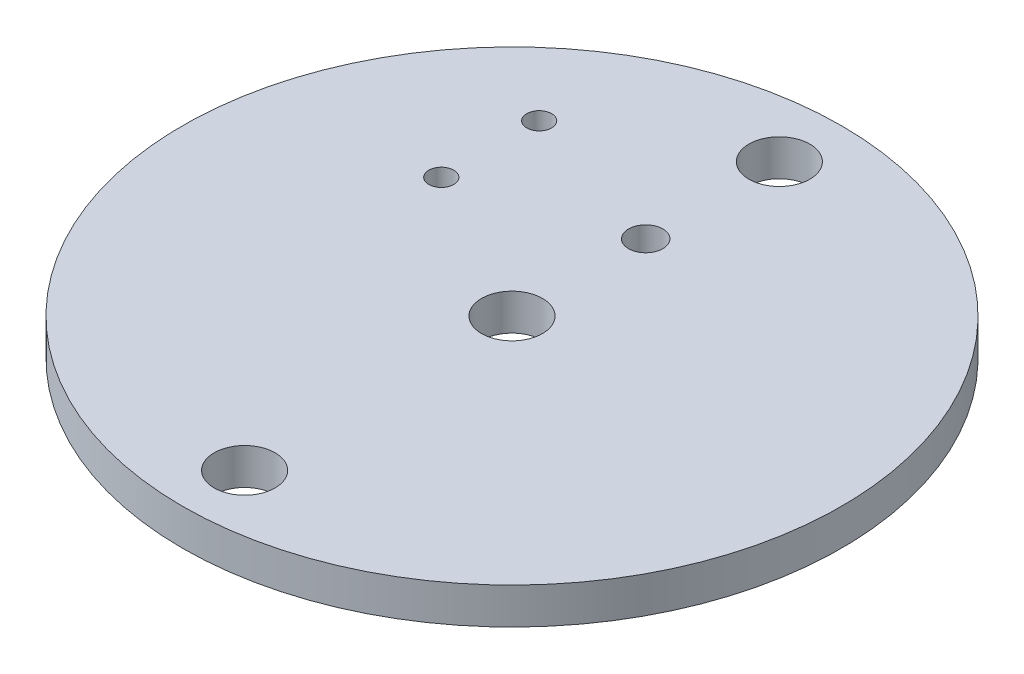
ISO-10303-21;
HEADER;
FILE_DESCRIPTION(('STEP AP214'),'2;1');
FILE_NAME('part.step','',(''),(''),'','','');
FILE_SCHEMA(('AUTOMOTIVE_DESIGN { 1 0 10303 214 1 1 1 1 }'));
ENDSEC;
DATA;
#1=APPLICATION_CONTEXT('core data for automotive mechanical design processes');
#2=APPLICATION_PROTOCOL_DEFINITION('international standard','automotive_design',2000,#1);
#3=PRODUCT_CONTEXT('',#1,'mechanical');
#4=PRODUCT('Part','Part','',(#3));
#5=PRODUCT_RELATED_PRODUCT_CATEGORY('part','',(#4));
#6=PRODUCT_DEFINITION_FORMATION('','',#4);
#7=PRODUCT_DEFINITION_CONTEXT('part definition',#1,'design');
#8=PRODUCT_DEFINITION('design','',#6,#7);
#9=PRODUCT_DEFINITION_SHAPE('','',#8);
#10=(LENGTH_UNIT() NAMED_UNIT(*) SI_UNIT(.MILLI.,.METRE.));
#11=(NAMED_UNIT(*) PLANE_ANGLE_UNIT() SI_UNIT($,.RADIAN.));
#12=(NAMED_UNIT(*) SI_UNIT($,.STERADIAN.) SOLID_ANGLE_UNIT());
#13=UNCERTAINTY_MEASURE_WITH_UNIT(LENGTH_MEASURE(1.E-05),#10,'distance_accuracy_value','');
#14=(GEOMETRIC_REPRESENTATION_CONTEXT(3) GLOBAL_UNCERTAINTY_ASSIGNED_CONTEXT((#13)) GLOBAL_UNIT_ASSIGNED_CONTEXT((#10,
#11,#12)) REPRESENTATION_CONTEXT('',''));
#15=CARTESIAN_POINT('',(0.,0.,0.));
#16=DIRECTION('',(0.,0.,1.));
#17=DIRECTION('',(1.,0.,0.));
#18=AXIS2_PLACEMENT_3D('',#15,#16,#17);
#19=CARTESIAN_POINT('',(0.,2.9718,0.));
#20=DIRECTION('',(0.,-1.,0.));
#21=DIRECTION('',(0.,0.,-1.));
#22=AXIS2_PLACEMENT_3D('',#19,#20,#21);
#23=CYLINDRICAL_SURFACE('',#22,26.924);
#24=CARTESIAN_POINT('',(0.,2.9718,0.));
#25=DIRECTION('',(0.,1.,0.));
#26=DIRECTION('',(0.,0.,1.));
#27=AXIS2_PLACEMENT_3D('',#24,#25,#26);
#28=CIRCLE('',#27,26.924);
#29=CARTESIAN_POINT('',(0.,2.9718,26.924));
#30=VERTEX_POINT('',#29);
#31=EDGE_CURVE('E10',#30,#30,#28,.T.);
#32=ORIENTED_EDGE('',*,*,#31,.F.);
#33=EDGE_LOOP('',(#32));
#34=FACE_BOUND('',#33,.T.);
#35=CARTESIAN_POINT('',(0.,0.,0.));
#36=DIRECTION('',(0.,1.,0.));
#37=DIRECTION('',(0.,0.,1.));
#38=AXIS2_PLACEMENT_3D('',#35,#36,#37);
#39=CIRCLE('',#38,26.924);
#40=CARTESIAN_POINT('',(0.,0.,26.924));
#41=VERTEX_POINT('',#40);
#42=EDGE_CURVE('E42',#41,#41,#39,.T.);
#43=ORIENTED_EDGE('',*,*,#42,.T.);
#44=EDGE_LOOP('',(#43));
#45=FACE_BOUND('',#44,.T.);
#46=ADVANCED_FACE('F39',(#34,#45),#23,.T.);
#47=CARTESIAN_POINT('',(0.,2.9718,0.));
#48=DIRECTION('',(0.,1.,0.));
#49=DIRECTION('',(0.,0.,1.));
#50=AXIS2_PLACEMENT_3D('',#47,#48,#49);
#51=PLANE('',#50);
#52=CARTESIAN_POINT('',(0.,2.9718,-10.922));
#53=DIRECTION('',(0.,1.,0.));
#54=DIRECTION('',(0.,0.,1.));
#55=AXIS2_PLACEMENT_3D('',#52,#53,#54);
#56=CIRCLE('',#55,1.4);
#57=CARTESIAN_POINT('',(0.,2.9718,-9.522));
#58=VERTEX_POINT('',#57);
#59=EDGE_CURVE('E93',#58,#58,#56,.T.);
#60=ORIENTED_EDGE('',*,*,#59,.F.);
#61=EDGE_LOOP('',(#60));
#62=FACE_BOUND('',#61,.T.);
#63=CARTESIAN_POINT('',(-12.7,2.9718,-14.922));
#64=DIRECTION('',(0.,1.,0.));
#65=DIRECTION('',(0.,0.,1.));
#66=AXIS2_PLACEMENT_3D('',#63,#64,#65);
#67=CIRCLE('',#66,1.016);
#68=CARTESIAN_POINT('',(-12.7,2.9718,-13.906));
#69=VERTEX_POINT('',#68);
#70=EDGE_CURVE('E85',#69,#69,#67,.T.);
#71=ORIENTED_EDGE('',*,*,#70,.F.);
#72=EDGE_LOOP('',(#71));
#73=FACE_BOUND('',#72,.T.);
#74=CARTESIAN_POINT('',(-12.7,2.9718,-6.922));
#75=DIRECTION('',(0.,1.,0.));
#76=DIRECTION('',(0.,0.,1.));
#77=AXIS2_PLACEMENT_3D('',#74,#75,#76);
#78=CIRCLE('',#77,1.016);
#79=CARTESIAN_POINT('',(-12.7,2.9718,-5.906));
#80=VERTEX_POINT('',#79);
#81=EDGE_CURVE('E77',#80,#80,#78,.T.);
#82=ORIENTED_EDGE('',*,*,#81,.F.);
#83=EDGE_LOOP('',(#82));
#84=FACE_BOUND('',#83,.T.);
#85=CARTESIAN_POINT('',(0.,2.9718,0.));
#86=DIRECTION('',(0.,1.,0.));
#87=DIRECTION('',(0.,0.,1.));
#88=AXIS2_PLACEMENT_3D('',#85,#86,#87);
#89=CIRCLE('',#88,2.4892);
#90=CARTESIAN_POINT('',(0.,2.9718,2.4892));
#91=VERTEX_POINT('',#90);
#92=EDGE_CURVE('E72',#91,#91,#89,.T.);
#93=ORIENTED_EDGE('',*,*,#92,.F.);
#94=EDGE_LOOP('',(#93));
#95=FACE_BOUND('',#94,.T.);
#96=CARTESIAN_POINT('',(0.,2.9718,21.844));
#97=DIRECTION('',(0.,1.,0.));
#98=DIRECTION('',(0.,0.,1.));
#99=AXIS2_PLACEMENT_3D('',#96,#97,#98);
#100=CIRCLE('',#99,2.4892);
#101=CARTESIAN_POINT('',(0.,2.9718,24.3332));
#102=VERTEX_POINT('',#101);
#103=EDGE_CURVE('E64',#102,#102,#100,.T.);
#104=ORIENTED_EDGE('',*,*,#103,.F.);
#105=EDGE_LOOP('',(#104));
#106=FACE_BOUND('',#105,.T.);
#107=CARTESIAN_POINT('',(0.,2.9718,-21.844));
#108=DIRECTION('',(0.,1.,0.));
#109=DIRECTION('',(0.,0.,1.));
#110=AXIS2_PLACEMENT_3D('',#107,#108,#109);
#111=CIRCLE('',#110,2.4892);
#112=CARTESIAN_POINT('',(0.,2.9718,-19.3548));
#113=VERTEX_POINT('',#112);
#114=EDGE_CURVE('E56',#113,#113,#111,.T.);
#115=ORIENTED_EDGE('',*,*,#114,.F.);
#116=EDGE_LOOP('',(#115));
#117=FACE_BOUND('',#116,.T.);
#118=ORIENTED_EDGE('',*,*,#31,.T.);
#119=EDGE_LOOP('',(#118));
#120=FACE_BOUND('',#119,.T.);
#121=ADVANCED_FACE('F111',(#62,#73,#84,#95,#106,#117,#120),#51,.T.);
#122=CARTESIAN_POINT('',(0.,0.,0.));
#123=DIRECTION('',(0.,1.,0.));
#124=DIRECTION('',(0.,0.,1.));
#125=AXIS2_PLACEMENT_3D('',#122,#123,#124);
#126=PLANE('',#125);
#127=CARTESIAN_POINT('',(0.,0.,-10.922));
#128=DIRECTION('',(0.,1.,0.));
#129=DIRECTION('',(0.,0.,1.));
#130=AXIS2_PLACEMENT_3D('',#127,#128,#129);
#131=CIRCLE('',#130,1.4);
#132=CARTESIAN_POINT('',(0.,0.,-9.522));
#133=VERTEX_POINT('',#132);
#134=EDGE_CURVE('E76',#133,#133,#131,.T.);
#135=ORIENTED_EDGE('',*,*,#134,.T.);
#136=EDGE_LOOP('',(#135));
#137=FACE_BOUND('',#136,.T.);
#138=CARTESIAN_POINT('',(-12.7,0.,-14.922));
#139=DIRECTION('',(0.,1.,0.));
#140=DIRECTION('',(0.,0.,1.));
#141=AXIS2_PLACEMENT_3D('',#138,#139,#140);
#142=CIRCLE('',#141,1.016);
#143=CARTESIAN_POINT('',(-12.7,0.,-13.906));
#144=VERTEX_POINT('',#143);
#145=EDGE_CURVE('E89',#144,#144,#142,.T.);
#146=ORIENTED_EDGE('',*,*,#145,.T.);
#147=EDGE_LOOP('',(#146));
#148=FACE_BOUND('',#147,.T.);
#149=CARTESIAN_POINT('',(-12.7,0.,-6.922));
#150=DIRECTION('',(0.,1.,0.));
#151=DIRECTION('',(0.,0.,1.));
#152=AXIS2_PLACEMENT_3D('',#149,#150,#151);
#153=CIRCLE('',#152,1.016);
#154=CARTESIAN_POINT('',(-12.7,0.,-5.906));
#155=VERTEX_POINT('',#154);
#156=EDGE_CURVE('E81',#155,#155,#153,.T.);
#157=ORIENTED_EDGE('',*,*,#156,.T.);
#158=EDGE_LOOP('',(#157));
#159=FACE_BOUND('',#158,.T.);
#160=CARTESIAN_POINT('',(0.,0.,0.));
#161=DIRECTION('',(0.,1.,0.));
#162=DIRECTION('',(0.,0.,1.));
#163=AXIS2_PLACEMENT_3D('',#160,#161,#162);
#164=CIRCLE('',#163,2.4892);
#165=CARTESIAN_POINT('',(0.,0.,2.4892));
#166=VERTEX_POINT('',#165);
#167=EDGE_CURVE('E68',#166,#166,#164,.T.);
#168=ORIENTED_EDGE('',*,*,#167,.T.);
#169=EDGE_LOOP('',(#168));
#170=FACE_BOUND('',#169,.T.);
#171=CARTESIAN_POINT('',(0.,0.,21.844));
#172=DIRECTION('',(0.,1.,0.));
#173=DIRECTION('',(0.,0.,1.));
#174=AXIS2_PLACEMENT_3D('',#171,#172,#173);
#175=CIRCLE('',#174,2.4892);
#176=CARTESIAN_POINT('',(0.,0.,24.3332));
#177=VERTEX_POINT('',#176);
#178=EDGE_CURVE('E60',#177,#177,#175,.T.);
#179=ORIENTED_EDGE('',*,*,#178,.T.);
#180=EDGE_LOOP('',(#179));
#181=FACE_BOUND('',#180,.T.);
#182=CARTESIAN_POINT('',(0.,0.,-21.844));
#183=DIRECTION('',(0.,1.,0.));
#184=DIRECTION('',(0.,0.,1.));
#185=AXIS2_PLACEMENT_3D('',#182,#183,#184);
#186=CIRCLE('',#185,2.4892);
#187=CARTESIAN_POINT('',(0.,0.,-19.3548));
#188=VERTEX_POINT('',#187);
#189=EDGE_CURVE('E51',#188,#188,#186,.T.);
#190=ORIENTED_EDGE('',*,*,#189,.T.);
#191=EDGE_LOOP('',(#190));
#192=FACE_BOUND('',#191,.T.);
#193=ORIENTED_EDGE('',*,*,#42,.F.);
#194=EDGE_LOOP('',(#193));
#195=FACE_BOUND('',#194,.T.);
#196=ADVANCED_FACE('F101',(#137,#148,#159,#170,#181,#192,#195),#126,.F.);
#197=CARTESIAN_POINT('',(0.,2.9718,-21.844));
#198=DIRECTION('',(0.,1.,0.));
#199=DIRECTION('',(0.,0.,1.));
#200=AXIS2_PLACEMENT_3D('',#197,#198,#199);
#201=CYLINDRICAL_SURFACE('',#200,2.4892);
#202=ORIENTED_EDGE('',*,*,#189,.F.);
#203=EDGE_LOOP('',(#202));
#204=FACE_BOUND('',#203,.T.);
#205=ORIENTED_EDGE('',*,*,#114,.T.);
#206=EDGE_LOOP('',(#205));
#207=FACE_BOUND('',#206,.T.);
#208=ADVANCED_FACE('F125',(#204,#207),#201,.F.);
#209=CARTESIAN_POINT('',(0.,2.9718,21.844));
#210=DIRECTION('',(0.,1.,0.));
#211=DIRECTION('',(0.,0.,1.));
#212=AXIS2_PLACEMENT_3D('',#209,#210,#211);
#213=CYLINDRICAL_SURFACE('',#212,2.4892);
#214=ORIENTED_EDGE('',*,*,#178,.F.);
#215=EDGE_LOOP('',(#214));
#216=FACE_BOUND('',#215,.T.);
#217=ORIENTED_EDGE('',*,*,#103,.T.);
#218=EDGE_LOOP('',(#217));
#219=FACE_BOUND('',#218,.T.);
#220=ADVANCED_FACE('F127',(#216,#219),#213,.F.);
#221=CARTESIAN_POINT('',(0.,2.9718,0.));
#222=DIRECTION('',(0.,1.,0.));
#223=DIRECTION('',(0.,0.,1.));
#224=AXIS2_PLACEMENT_3D('',#221,#222,#223);
#225=CYLINDRICAL_SURFACE('',#224,2.4892);
#226=ORIENTED_EDGE('',*,*,#167,.F.);
#227=EDGE_LOOP('',(#226));
#228=FACE_BOUND('',#227,.T.);
#229=ORIENTED_EDGE('',*,*,#92,.T.);
#230=EDGE_LOOP('',(#229));
#231=FACE_BOUND('',#230,.T.);
#232=ADVANCED_FACE('F134',(#228,#231),#225,.F.);
#233=CARTESIAN_POINT('',(-12.7,0.,-6.922));
#234=DIRECTION('',(0.,1.,0.));
#235=DIRECTION('',(0.,0.,1.));
#236=AXIS2_PLACEMENT_3D('',#233,#234,#235);
#237=CYLINDRICAL_SURFACE('',#236,1.016);
#238=ORIENTED_EDGE('',*,*,#156,.F.);
#239=EDGE_LOOP('',(#238));
#240=FACE_BOUND('',#239,.T.);
#241=ORIENTED_EDGE('',*,*,#81,.T.);
#242=EDGE_LOOP('',(#241));
#243=FACE_BOUND('',#242,.T.);
#244=ADVANCED_FACE('F160',(#240,#243),#237,.F.);
#245=CARTESIAN_POINT('',(-12.7,0.,-14.922));
#246=DIRECTION('',(0.,1.,0.));
#247=DIRECTION('',(0.,0.,1.));
#248=AXIS2_PLACEMENT_3D('',#245,#246,#247);
#249=CYLINDRICAL_SURFACE('',#248,1.016);
#250=ORIENTED_EDGE('',*,*,#145,.F.);
#251=EDGE_LOOP('',(#250));
#252=FACE_BOUND('',#251,.T.);
#253=ORIENTED_EDGE('',*,*,#70,.T.);
#254=EDGE_LOOP('',(#253));
#255=FACE_BOUND('',#254,.T.);
#256=ADVANCED_FACE('F107',(#252,#255),#249,.F.);
#257=CARTESIAN_POINT('',(0.,0.,-10.922));
#258=DIRECTION('',(0.,1.,0.));
#259=DIRECTION('',(0.,0.,1.));
#260=AXIS2_PLACEMENT_3D('',#257,#258,#259);
#261=CYLINDRICAL_SURFACE('',#260,1.4);
#262=ORIENTED_EDGE('',*,*,#134,.F.);
#263=EDGE_LOOP('',(#262));
#264=FACE_BOUND('',#263,.T.);
#265=ORIENTED_EDGE('',*,*,#59,.T.);
#266=EDGE_LOOP('',(#265));
#267=FACE_BOUND('',#266,.T.);
#268=ADVANCED_FACE('F104',(#264,#267),#261,.F.);
#269=CLOSED_SHELL('',(#46,#121,#196,#208,#220,#232,#244,#256,#268));
#270=MANIFOLD_SOLID_BREP('B2',#269);
#271=ADVANCED_BREP_SHAPE_REPRESENTATION('',(#18,#270),#14);
#272=SHAPE_DEFINITION_REPRESENTATION(#9,#271);
ENDSEC;
END-ISO-10303-21;
